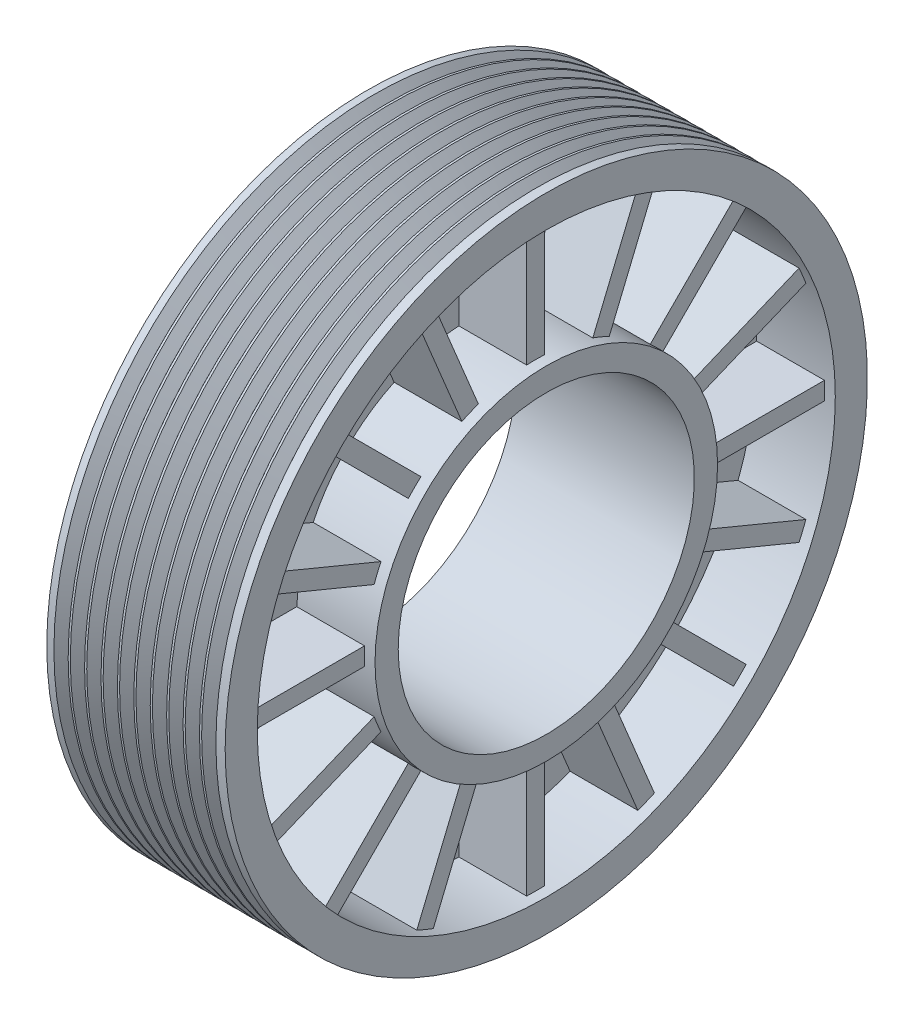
from build123d import *

# Parameters (mm, degrees)
ESQUISSE2_W                  = 2.5
ESQUISSE2_H                  = 20.25
EXTRU_MINCE4_DEPTH           = 11
R_P_TITION_CIRCULAIRE1_COUNT = 16
ESQUISSE3_R                  = 8.5
ESQUISSE3_R_2                = 7
EXTRU_MINCE5_DEPTH           = 9.5
ENL_V_MAT_EXTRU_1_DEPTH      = 84.068119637
ENL_V_MAT_EXTRU_1_DEPTH_BACK = 9.5
ESQUISSE4_R                  = 7
R_P_TITION_LIN_AIRE2_COUNT   = 10
R_P_TITION_LIN_AIRE2_PITCH   = 2.3


with BuildPart() as part:
    # Esquisse1 → R_volution1 (revolve)
    with BuildSketch(Plane.XY, mode=Mode.PRIVATE) as r_volution1_sk:
        Polygon((12.5, 0), (-12.5, 0), (-12.5, 3.25), (-1.5, 3.25), (-1.5, 19.75), (-12.5, 19.75), (-12.5, 24.25), (12.5, 24.25), (12.5, 19.75), (1.5, 19.75), (1.5, 3.25), (12.5, 3.25), align=None)
    revolve(r_volution1_sk.sketch.rotate(Axis((-30.163219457, -20.75, 0), (1, 0, 0)), 90), axis=Axis((-30.163219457, -20.75, 0), (1, 0, 0)))

    # Esquisse2 → Extru.-Mince4 (add, symmetric)
    with BuildSketch(Plane(origin=(0, 0, 0), x_dir=(0, 0, -1), z_dir=(1, 0, 0))):
        with Locations((0, 12.125)):
            Rectangle(ESQUISSE2_W, ESQUISSE2_H)
    extru_mince4 = extrude(amount=EXTRU_MINCE4_DEPTH, both=True)

    # R_p_tition circulaire1: Extru.-Mince4 ×16 about axis
    r_p_tition_circulaire1_axis = Axis((0, -20.75, 0), (1, 0, 0))
    for i in range(1, R_P_TITION_CIRCULAIRE1_COUNT):
        add(extru_mince4.rotate(r_p_tition_circulaire1_axis, i * 360 / R_P_TITION_CIRCULAIRE1_COUNT))

    # Esquisse3 → Extru.-Mince5 (add)
    with BuildSketch(Plane.ZY.offset(11)):
        with Locations((-25.809397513, 5.059397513)):
            Circle(ESQUISSE3_R)
        with Locations((-25.809397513, 5.059397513)):
            Circle(ESQUISSE3_R_2, mode=Mode.SUBTRACT)
    extrude(amount=-EXTRU_MINCE5_DEPTH)

    # Esquisse4 → Enl_v. mat.-Extru.1 (cut, two sides: drawn at the far end of the back side and taken through both)
    with BuildSketch(Plane.ZY.offset(11).offset(-ENL_V_MAT_EXTRU_1_DEPTH_BACK)):
        with Locations(Location((-25.809397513, 5.059397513, 0), (0, 0, 75.454191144))):
            Circle(ESQUISSE4_R)
    extrude(amount=ENL_V_MAT_EXTRU_1_DEPTH + ENL_V_MAT_EXTRU_1_DEPTH_BACK, mode=Mode.SUBTRACT)

    # Esquisse5 → Enl_vement de mati_re-R_volution6 (revolve, cut)
    with BuildSketch(Plane.XY, mode=Mode.PRIVATE) as enl_vement_de_mati_re_r_volution6_sk:
        Polygon((-11.5, 24.25), (-10.5, 22.85), (-9.5, 24.25), (-9.5, 24.35), (-11.5, 24.35), align=None)
    enl_vement_de_mati_re_r_volution6 = revolve(enl_vement_de_mati_re_r_volution6_sk.sketch.rotate(Axis((-30.163219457, -20.75, 0), (1, 0, 0)), 90), axis=Axis((-30.163219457, -20.75, 0), (1, 0, 0)), mode=Mode.SUBTRACT)

    # R_p_tition lin_aire2: Enl_vement de mati_re-R_volution6 ×10
    with Locations(*[(i * R_P_TITION_LIN_AIRE2_PITCH, 0, 0) for i in range(1, R_P_TITION_LIN_AIRE2_COUNT)]):
        add(enl_vement_de_mati_re_r_volution6, mode=Mode.SUBTRACT)


solid = part.part
